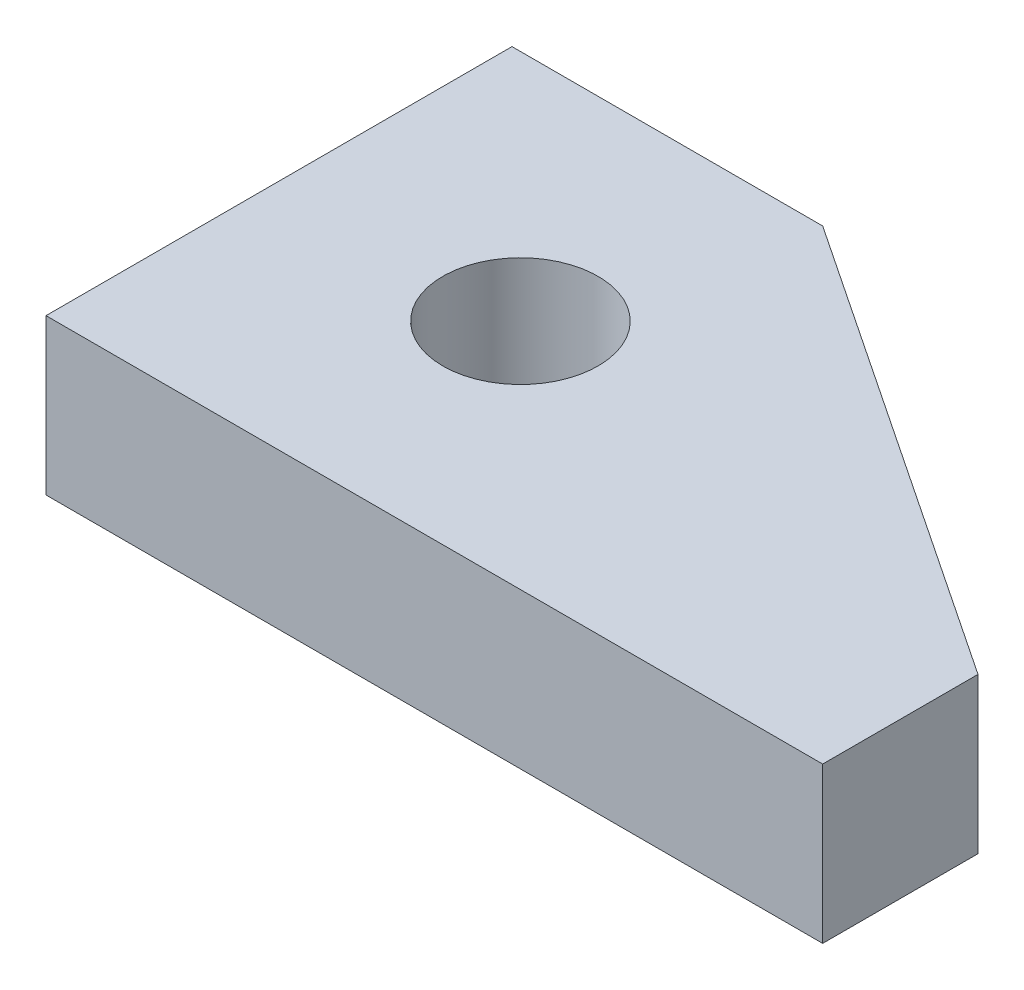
from build123d import *

# Parameters (mm, degrees)
RESSALTO_EXTRUS_O1_DEPTH = 10
ESBO_O2_R                = 5
CORTE_EXTRUS_O1_DEPTH    = 10


with BuildPart() as part:
    # Esbo_o1 → Ressalto-extrus_o1 (new body)
    with BuildSketch(Plane(origin=(0, 0, 0), x_dir=(1, 0, 0), z_dir=(0, 1, 0))):
        Polygon((0, 0), (0, -30), (50, -30), (50, -20), (20, 0), align=None)
    extrude(amount=RESSALTO_EXTRUS_O1_DEPTH)

    # Esbo_o2 → Corte-extrus_o1 (cut)
    with BuildSketch(Plane(origin=(0, 10, 0), x_dir=(1, 0, 0), z_dir=(0, 1, 0))):
        with Locations(Location((15.579171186, -15.03609513, 0), (0, 0, 270))):
            Circle(ESBO_O2_R)
    extrude(amount=-CORTE_EXTRUS_O1_DEPTH, mode=Mode.SUBTRACT)


solid = part.part
